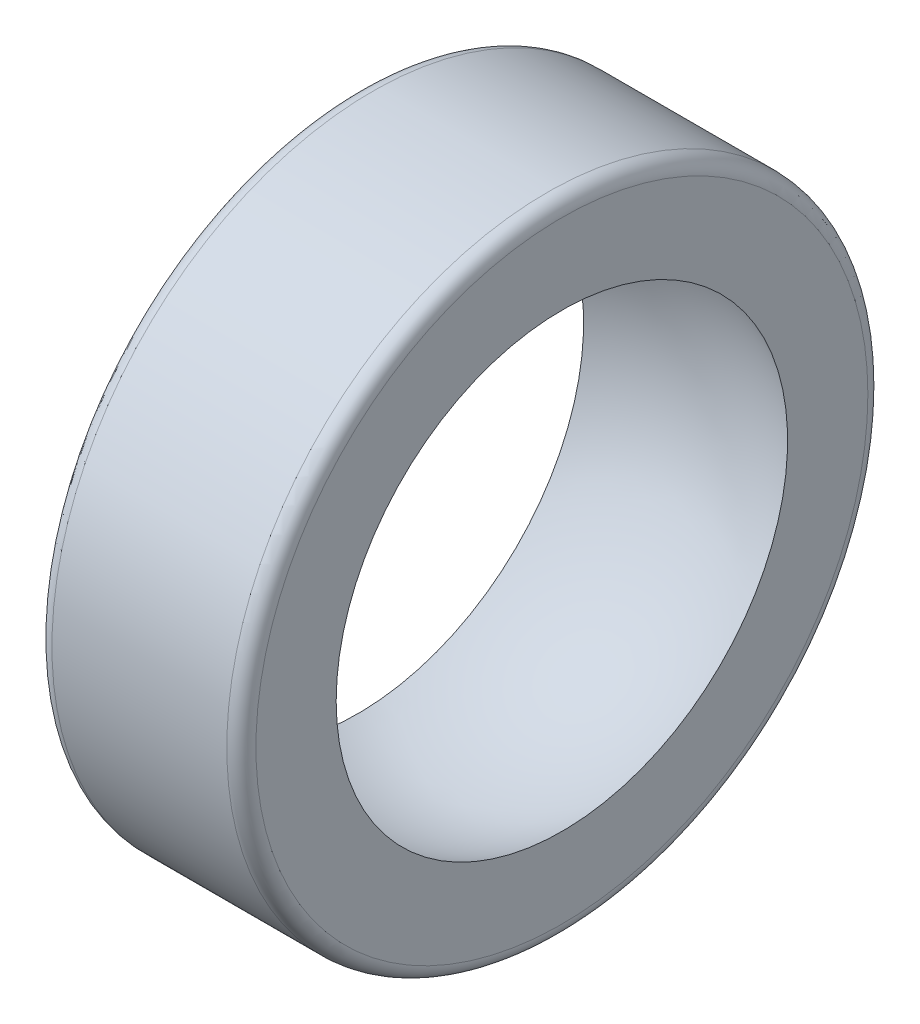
from build123d import *

# Parameters (mm, degrees)
CONG_1_R = 0.5


with BuildPart() as part:
    # Esquisse1 → Base-R_volution (revolve)
    with BuildSketch(Plane.XY, mode=Mode.PRIVATE) as base_r_volution_sk:
        with BuildLine():
            Line((-3.5, 11), (-3.5, 7.745966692))
            ThreePointArc((-3.5, 7.745966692), (0, 8.5), (3.5, 7.745966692))
            Line((3.5, 7.745966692), (3.5, 11))
            Line((3.5, 11), (-3.5, 11))
        make_face()
    revolve(base_r_volution_sk.sketch.rotate(Axis((-60, 0, 0), (1, 0, 0)), 270), axis=Axis((-60, 0, 0), (1, 0, 0)))

    # Cong_1
    cong_1_edges = [part.edges().sort_by_distance(p)[0] for p in [
        (3.5, 0, 11),
        (-3.5, 0, 11),
    ]]
    fillet(cong_1_edges, radius=CONG_1_R)


solid = part.part
